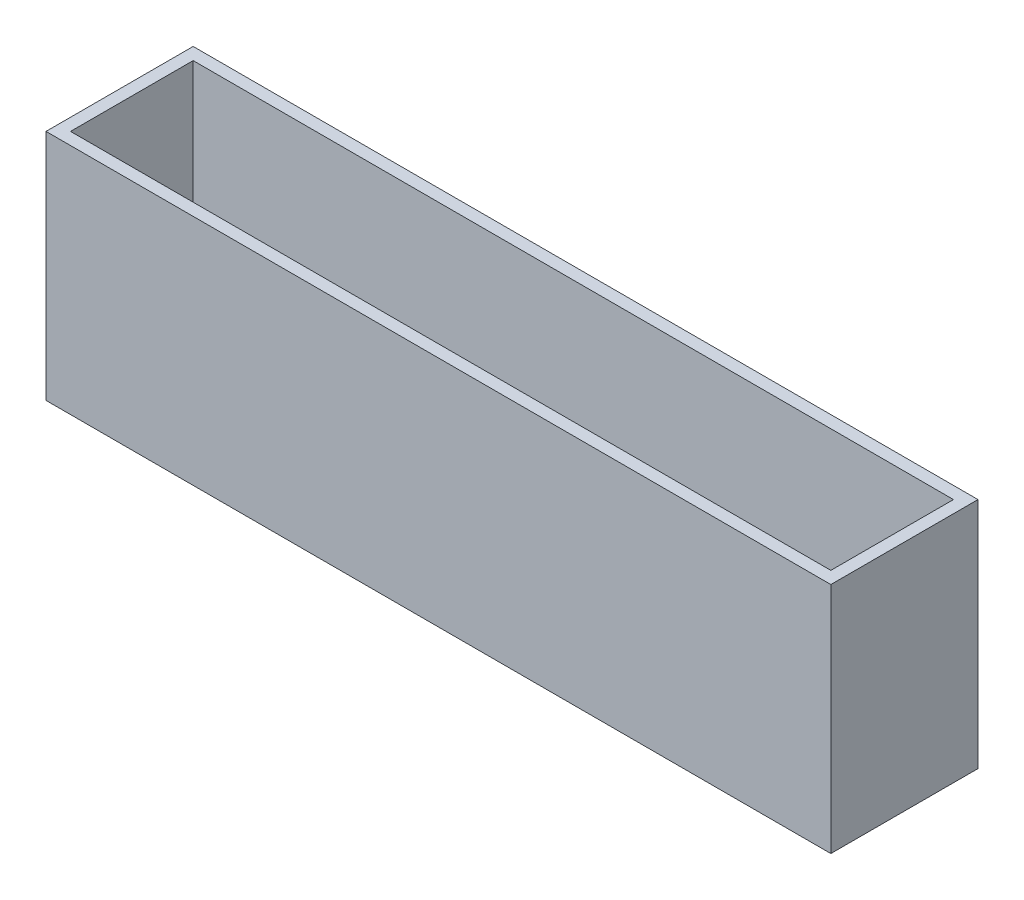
from build123d import *

# Parameters (mm, degrees)
EXTRUDE2_DEPTH     = 12.7
SKETCH2_W          = 406.4
SKETCH2_H          = 107.95
SKETCH2_H_2        = 12.7
EXTRUDE3_DEPTH     = 6.35
SKETCH3_W          = 63.5
SKETCH3_H          = 107.95
EXTRUDE4_DEPTH     = 6.35
SKETCH4_W          = 393.46463891
SKETCH4_H          = 63.494722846
CUT_EXTRUDE1_DEPTH = 6.35


with BuildPart() as part:
    # Sketch1 → Extrude2 (new body)
    with BuildSketch(Plane(origin=(0, 0, 0), x_dir=(1, 0, 0), z_dir=(0, 1, 0))):
        with BuildLine():
            Line((12.7, -4.7625), (12.7, -38.1))
            Line((12.7, -38.1), (203.2, -38.1))
            Line((203.2, -38.1), (203.2, 38.1))
            Line((203.2, 38.1), (12.7, 38.1))
            Line((12.7, 38.1), (12.7, 4.7625))
            Line((12.7, 4.7625), (152.4, 4.7625))
            ThreePointArc((152.4, 4.7625), (157.1625, 0), (152.4, -4.7625))
            Line((152.4, -4.7625), (17.4625, -4.7625))
            Line((17.4625, -4.7625), (12.7, -4.7625))
        make_face()
        with BuildLine():
            Line((-203.2, -38.1), (12.7, -38.1))
            Line((12.7, -38.1), (12.7, -4.7625))
            Line((12.7, -4.7625), (-152.4, -4.7625))
            ThreePointArc((-152.4, -4.7625), (-157.1625, 0), (-152.4, 4.7625))
            Line((-152.4, 4.7625), (-17.4625, 4.7625))
            Line((-17.4625, 4.7625), (12.7, 4.7625))
            Line((12.7, 4.7625), (12.7, 38.1))
            Line((12.7, 38.1), (-203.2, 38.1))
            Line((-203.2, 38.1), (-203.2, -38.1))
        make_face()
    extrude(amount=EXTRUDE2_DEPTH)

    # Sketch2 → Extrude3 (add)
    with BuildSketch(Plane.XY.offset(38.1)):
        with Locations((0, 66.675)):
            Rectangle(SKETCH2_W, SKETCH2_H)
        with Locations((0, 6.35)):
            Rectangle(SKETCH2_W, SKETCH2_H_2)
    extrude3 = extrude(amount=-EXTRUDE3_DEPTH)

    # Mirror2: Extrude3 across plane
    add(extrude3.mirror(Plane.XY))

    # Sketch3 → Extrude4 (add)
    with BuildSketch(Plane(origin=(203.2, 0, 0), x_dir=(0, 0, -1), z_dir=(1, 0, 0))):
        with Locations((0, 66.675)):
            Rectangle(SKETCH3_W, SKETCH3_H)
    extrude4 = extrude(amount=-EXTRUDE4_DEPTH)

    # Mirror3: Extrude4 across plane
    add(extrude4.mirror(Plane(origin=(0, 0, 0), x_dir=(0, 0, 1), z_dir=(1, 0, 0))))

    # Sketch4 → Cut-Extrude1 (cut)
    with BuildSketch(Plane.XZ):
        Rectangle(SKETCH4_W, SKETCH4_H)
    extrude(amount=-CUT_EXTRUDE1_DEPTH, mode=Mode.SUBTRACT)


solid = part.part
